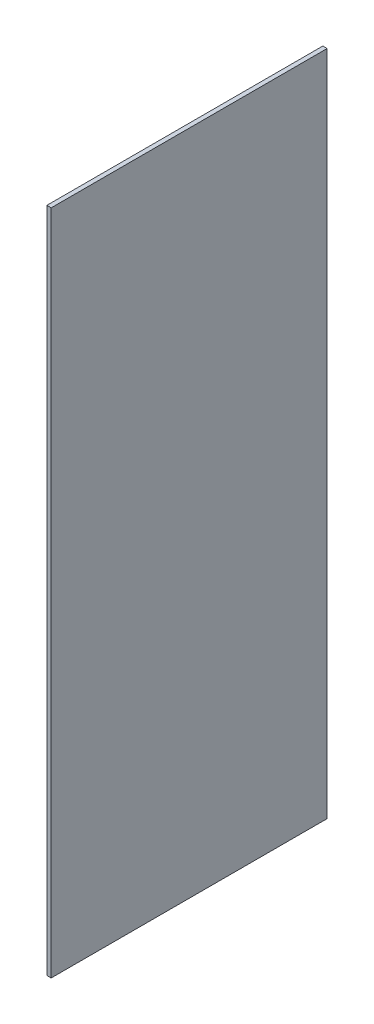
from build123d import *

# Parameters (mm, degrees)
SKETCH1_W           = 9.525
SKETCH1_H           = 609.6
BOSS_EXTRUDE1_DEPTH = 1473.2


with BuildPart() as part:
    # Sketch1 → Boss-Extrude1 (new body)
    with BuildSketch(Plane(origin=(0, 0, 0), x_dir=(-1, 0, 0), z_dir=(0, 1, 0))):
        Rectangle(SKETCH1_W, SKETCH1_H)
    extrude(amount=BOSS_EXTRUDE1_DEPTH)


solid = part.part
